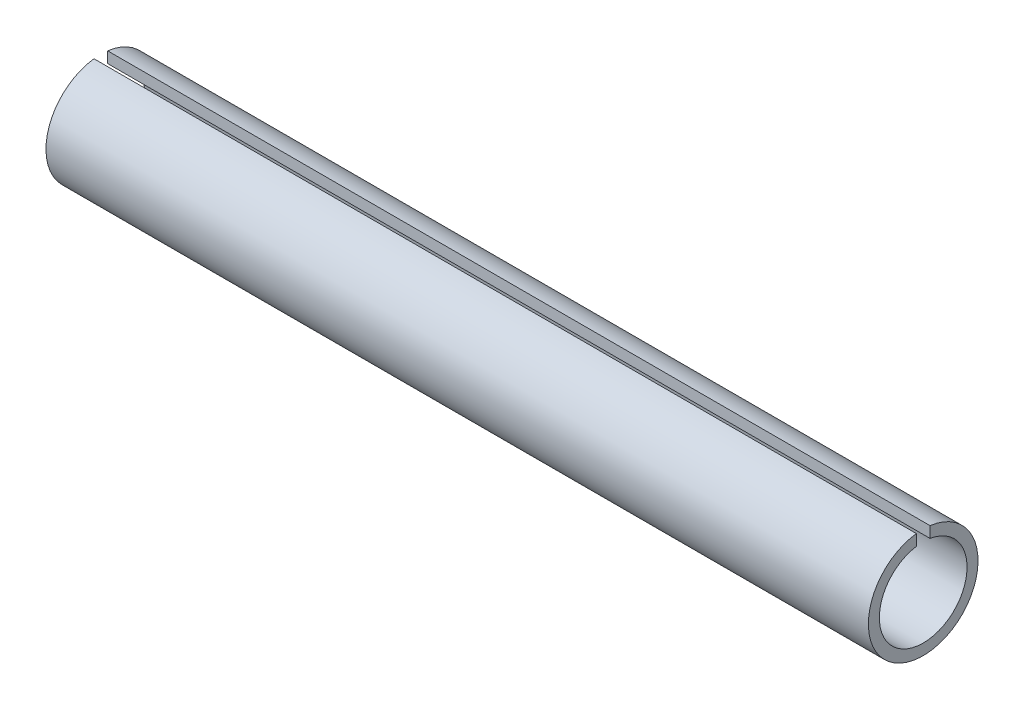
ISO-10303-21;
HEADER;
FILE_DESCRIPTION(('STEP AP214'),'2;1');
FILE_NAME('part.step','',(''),(''),'','','');
FILE_SCHEMA(('AUTOMOTIVE_DESIGN { 1 0 10303 214 1 1 1 1 }'));
ENDSEC;
DATA;
#1=APPLICATION_CONTEXT('core data for automotive mechanical design processes');
#2=APPLICATION_PROTOCOL_DEFINITION('international standard','automotive_design',2000,#1);
#3=PRODUCT_CONTEXT('',#1,'mechanical');
#4=PRODUCT('Part','Part','',(#3));
#5=PRODUCT_RELATED_PRODUCT_CATEGORY('part','',(#4));
#6=PRODUCT_DEFINITION_FORMATION('','',#4);
#7=PRODUCT_DEFINITION_CONTEXT('part definition',#1,'design');
#8=PRODUCT_DEFINITION('design','',#6,#7);
#9=PRODUCT_DEFINITION_SHAPE('','',#8);
#10=(LENGTH_UNIT() NAMED_UNIT(*) SI_UNIT(.MILLI.,.METRE.));
#11=(NAMED_UNIT(*) PLANE_ANGLE_UNIT() SI_UNIT($,.RADIAN.));
#12=(NAMED_UNIT(*) SI_UNIT($,.STERADIAN.) SOLID_ANGLE_UNIT());
#13=UNCERTAINTY_MEASURE_WITH_UNIT(LENGTH_MEASURE(1.E-05),#10,'distance_accuracy_value','');
#14=(GEOMETRIC_REPRESENTATION_CONTEXT(3) GLOBAL_UNCERTAINTY_ASSIGNED_CONTEXT((#13)) GLOBAL_UNIT_ASSIGNED_CONTEXT((#10,
#11,#12)) REPRESENTATION_CONTEXT('',''));
#15=CARTESIAN_POINT('',(0.,0.,0.));
#16=DIRECTION('',(0.,0.,1.));
#17=DIRECTION('',(1.,0.,0.));
#18=AXIS2_PLACEMENT_3D('',#15,#16,#17);
#19=CARTESIAN_POINT('',(15.,0.,0.));
#20=DIRECTION('',(-1.,0.,0.));
#21=DIRECTION('',(0.,0.,1.));
#22=AXIS2_PLACEMENT_3D('',#19,#20,#21);
#23=CYLINDRICAL_SURFACE('',#22,1.);
#24=CARTESIAN_POINT('',(15.,0.,0.));
#25=DIRECTION('',(1.,0.,0.));
#26=DIRECTION('',(0.,0.,-1.));
#27=AXIS2_PLACEMENT_3D('',#24,#25,#26);
#28=CIRCLE('',#27,1.);
#29=CARTESIAN_POINT('',(15.,0.992156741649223,0.125000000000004));
#30=VERTEX_POINT('',#29);
#31=CARTESIAN_POINT('',(15.,0.99215674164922,-0.124999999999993));
#32=VERTEX_POINT('',#31);
#33=EDGE_CURVE('E82',#30,#32,#28,.T.);
#34=ORIENTED_EDGE('',*,*,#33,.F.);
#35=DIRECTION('',(-1.,0.,0.));
#36=VECTOR('',#35,1.);
#37=CARTESIAN_POINT('',(15.,0.992156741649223,0.125000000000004));
#38=LINE('',#37,#36);
#39=CARTESIAN_POINT('',(0.,0.992156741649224,0.125000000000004));
#40=VERTEX_POINT('',#39);
#41=EDGE_CURVE('E66',#30,#40,#38,.T.);
#42=ORIENTED_EDGE('',*,*,#41,.T.);
#43=CARTESIAN_POINT('',(0.,0.,0.));
#44=DIRECTION('',(1.,0.,0.));
#45=DIRECTION('',(0.,0.,-1.));
#46=AXIS2_PLACEMENT_3D('',#43,#44,#45);
#47=CIRCLE('',#46,1.);
#48=CARTESIAN_POINT('',(0.,0.992156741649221,-0.124999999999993));
#49=VERTEX_POINT('',#48);
#50=EDGE_CURVE('E87',#40,#49,#47,.T.);
#51=ORIENTED_EDGE('',*,*,#50,.T.);
#52=DIRECTION('',(-1.,0.,0.));
#53=VECTOR('',#52,1.);
#54=CARTESIAN_POINT('',(15.,0.99215674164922,-0.124999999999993));
#55=LINE('',#54,#53);
#56=EDGE_CURVE('E75',#49,#32,#55,.F.);
#57=ORIENTED_EDGE('',*,*,#56,.T.);
#58=EDGE_LOOP('',(#34,#42,#51,#57));
#59=FACE_BOUND('',#58,.T.);
#60=ADVANCED_FACE('F29',(#59),#23,.T.);
#61=CARTESIAN_POINT('',(15.,0.,0.));
#62=DIRECTION('',(1.,0.,0.));
#63=DIRECTION('',(0.,0.,-1.));
#64=AXIS2_PLACEMENT_3D('',#61,#62,#63);
#65=PLANE('',#64);
#66=DIRECTION('',(0.,-1.,0.));
#67=VECTOR('',#66,1.);
#68=CARTESIAN_POINT('',(15.,1.15509005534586,0.125000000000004));
#69=LINE('',#68,#67);
#70=CARTESIAN_POINT('',(15.,0.790174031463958,0.125000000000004));
#71=VERTEX_POINT('',#70);
#72=EDGE_CURVE('E43',#30,#71,#69,.T.);
#73=ORIENTED_EDGE('',*,*,#72,.F.);
#74=ORIENTED_EDGE('',*,*,#33,.T.);
#75=DIRECTION('',(0.,1.,0.));
#76=VECTOR('',#75,1.);
#77=CARTESIAN_POINT('',(15.,1.15509005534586,-0.124999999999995));
#78=LINE('',#77,#76);
#79=CARTESIAN_POINT('',(15.,0.790174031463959,-0.124999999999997));
#80=VERTEX_POINT('',#79);
#81=EDGE_CURVE('E84',#80,#32,#78,.T.);
#82=ORIENTED_EDGE('',*,*,#81,.F.);
#83=CARTESIAN_POINT('',(15.,0.,0.));
#84=DIRECTION('',(1.,0.,0.));
#85=DIRECTION('',(0.,0.,-1.));
#86=AXIS2_PLACEMENT_3D('',#83,#84,#85);
#87=CIRCLE('',#86,0.8);
#88=EDGE_CURVE('E74',#71,#80,#87,.T.);
#89=ORIENTED_EDGE('',*,*,#88,.F.);
#90=EDGE_LOOP('',(#73,#74,#82,#89));
#91=FACE_BOUND('',#90,.T.);
#92=ADVANCED_FACE('F80',(#91),#65,.T.);
#93=CARTESIAN_POINT('',(0.,0.,0.));
#94=DIRECTION('',(1.,0.,0.));
#95=DIRECTION('',(0.,0.,-1.));
#96=AXIS2_PLACEMENT_3D('',#93,#94,#95);
#97=PLANE('',#96);
#98=ORIENTED_EDGE('',*,*,#50,.F.);
#99=DIRECTION('',(0.,-1.,0.));
#100=VECTOR('',#99,1.);
#101=CARTESIAN_POINT('',(0.,1.15509005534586,0.125000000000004));
#102=LINE('',#101,#100);
#103=CARTESIAN_POINT('',(0.,0.790174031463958,0.125000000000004));
#104=VERTEX_POINT('',#103);
#105=EDGE_CURVE('E69',#40,#104,#102,.T.);
#106=ORIENTED_EDGE('',*,*,#105,.T.);
#107=CARTESIAN_POINT('',(0.,0.,0.));
#108=DIRECTION('',(1.,0.,0.));
#109=DIRECTION('',(0.,0.,-1.));
#110=AXIS2_PLACEMENT_3D('',#107,#108,#109);
#111=CIRCLE('',#110,0.8);
#112=CARTESIAN_POINT('',(0.,0.790174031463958,-0.124999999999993));
#113=VERTEX_POINT('',#112);
#114=EDGE_CURVE('E89',#104,#113,#111,.T.);
#115=ORIENTED_EDGE('',*,*,#114,.T.);
#116=DIRECTION('',(0.,1.,0.));
#117=VECTOR('',#116,1.);
#118=CARTESIAN_POINT('',(0.,1.15509005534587,-0.124999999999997));
#119=LINE('',#118,#117);
#120=EDGE_CURVE('E50',#113,#49,#119,.T.);
#121=ORIENTED_EDGE('',*,*,#120,.T.);
#122=EDGE_LOOP('',(#98,#106,#115,#121));
#123=FACE_BOUND('',#122,.T.);
#124=ADVANCED_FACE('F103',(#123),#97,.F.);
#125=CARTESIAN_POINT('',(0.,0.,0.));
#126=DIRECTION('',(1.,0.,0.));
#127=DIRECTION('',(0.,0.,-1.));
#128=AXIS2_PLACEMENT_3D('',#125,#126,#127);
#129=CYLINDRICAL_SURFACE('',#128,0.8);
#130=ORIENTED_EDGE('',*,*,#114,.F.);
#131=DIRECTION('',(1.,0.,0.));
#132=VECTOR('',#131,1.);
#133=CARTESIAN_POINT('',(0.,0.790174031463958,0.125000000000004));
#134=LINE('',#133,#132);
#135=EDGE_CURVE('E11',#104,#71,#134,.T.);
#136=ORIENTED_EDGE('',*,*,#135,.T.);
#137=ORIENTED_EDGE('',*,*,#88,.T.);
#138=DIRECTION('',(1.,0.,0.));
#139=VECTOR('',#138,1.);
#140=CARTESIAN_POINT('',(0.,0.790174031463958,-0.124999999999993));
#141=LINE('',#140,#139);
#142=EDGE_CURVE('E36',#80,#113,#141,.F.);
#143=ORIENTED_EDGE('',*,*,#142,.T.);
#144=EDGE_LOOP('',(#130,#136,#137,#143));
#145=FACE_BOUND('',#144,.T.);
#146=ADVANCED_FACE('F101',(#145),#129,.F.);
#147=CARTESIAN_POINT('',(0.,1.15509005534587,-0.124999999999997));
#148=DIRECTION('',(0.,0.,-1.));
#149=DIRECTION('',(0.,1.,0.));
#150=AXIS2_PLACEMENT_3D('',#147,#148,#149);
#151=PLANE('',#150);
#152=ORIENTED_EDGE('',*,*,#120,.F.);
#153=ORIENTED_EDGE('',*,*,#142,.F.);
#154=ORIENTED_EDGE('',*,*,#81,.T.);
#155=ORIENTED_EDGE('',*,*,#56,.F.);
#156=EDGE_LOOP('',(#152,#153,#154,#155));
#157=FACE_BOUND('',#156,.T.);
#158=ADVANCED_FACE('F98',(#157),#151,.F.);
#159=CARTESIAN_POINT('',(0.,1.15509005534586,0.125000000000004));
#160=DIRECTION('',(0.,0.,1.));
#161=DIRECTION('',(0.,-1.,0.));
#162=AXIS2_PLACEMENT_3D('',#159,#160,#161);
#163=PLANE('',#162);
#164=ORIENTED_EDGE('',*,*,#72,.T.);
#165=ORIENTED_EDGE('',*,*,#135,.F.);
#166=ORIENTED_EDGE('',*,*,#105,.F.);
#167=ORIENTED_EDGE('',*,*,#41,.F.);
#168=EDGE_LOOP('',(#164,#165,#166,#167));
#169=FACE_BOUND('',#168,.T.);
#170=ADVANCED_FACE('F67',(#169),#163,.F.);
#171=CLOSED_SHELL('',(#60,#92,#124,#146,#158,#170));
#172=MANIFOLD_SOLID_BREP('B2',#171);
#173=ADVANCED_BREP_SHAPE_REPRESENTATION('',(#18,#172),#14);
#174=SHAPE_DEFINITION_REPRESENTATION(#9,#173);
ENDSEC;
END-ISO-10303-21;
